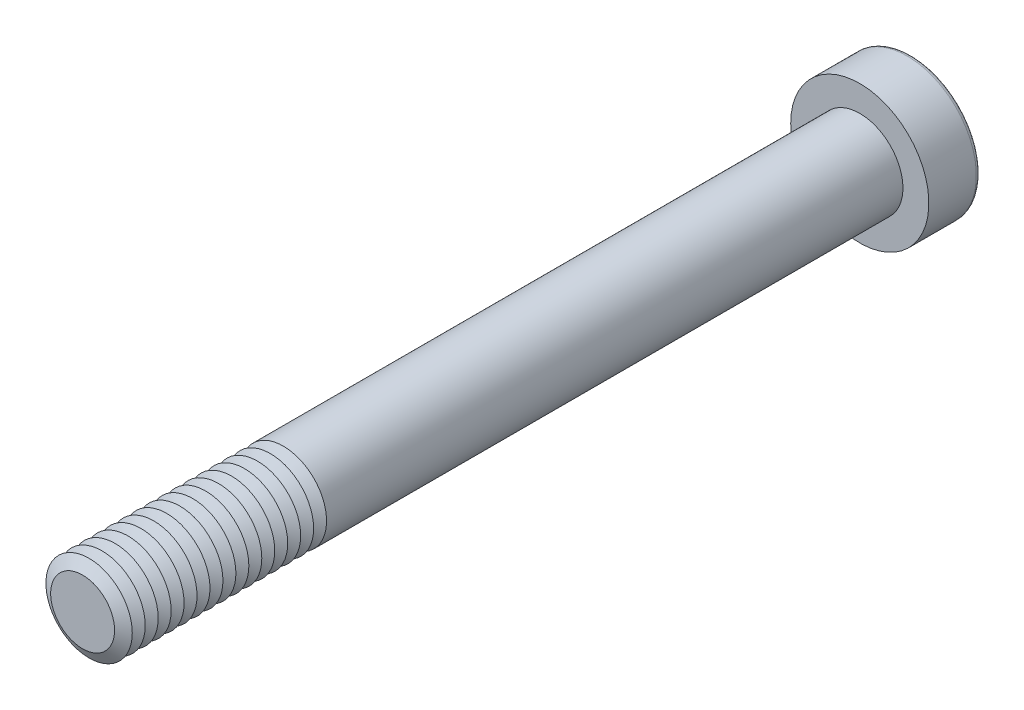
ISO-10303-21;
HEADER;
FILE_DESCRIPTION(('STEP AP214'),'2;1');
FILE_NAME('part.step','',(''),(''),'','','');
FILE_SCHEMA(('AUTOMOTIVE_DESIGN { 1 0 10303 214 1 1 1 1 }'));
ENDSEC;
DATA;
#1=APPLICATION_CONTEXT('core data for automotive mechanical design processes');
#2=APPLICATION_PROTOCOL_DEFINITION('international standard','automotive_design',2000,#1);
#3=PRODUCT_CONTEXT('',#1,'mechanical');
#4=PRODUCT('Part','Part','',(#3));
#5=PRODUCT_RELATED_PRODUCT_CATEGORY('part','',(#4));
#6=PRODUCT_DEFINITION_FORMATION('','',#4);
#7=PRODUCT_DEFINITION_CONTEXT('part definition',#1,'design');
#8=PRODUCT_DEFINITION('design','',#6,#7);
#9=PRODUCT_DEFINITION_SHAPE('','',#8);
#10=(LENGTH_UNIT() NAMED_UNIT(*) SI_UNIT(.MILLI.,.METRE.));
#11=(NAMED_UNIT(*) PLANE_ANGLE_UNIT() SI_UNIT($,.RADIAN.));
#12=(NAMED_UNIT(*) SI_UNIT($,.STERADIAN.) SOLID_ANGLE_UNIT());
#13=UNCERTAINTY_MEASURE_WITH_UNIT(LENGTH_MEASURE(1.E-05),#10,'distance_accuracy_value','');
#14=(GEOMETRIC_REPRESENTATION_CONTEXT(3) GLOBAL_UNCERTAINTY_ASSIGNED_CONTEXT((#13)) GLOBAL_UNIT_ASSIGNED_CONTEXT((#10,
#11,#12)) REPRESENTATION_CONTEXT('',''));
#15=CARTESIAN_POINT('',(0.,0.,0.));
#16=DIRECTION('',(0.,0.,1.));
#17=DIRECTION('',(1.,0.,0.));
#18=AXIS2_PLACEMENT_3D('',#15,#16,#17);
#19=CARTESIAN_POINT('',(0.,0.,84.75));
#20=DIRECTION('',(0.,0.,1.));
#21=DIRECTION('',(1.,0.,0.));
#22=AXIS2_PLACEMENT_3D('',#19,#20,#21);
#23=CONICAL_SURFACE('',#22,5.,1.0471975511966);
#24=CARTESIAN_POINT('',(0.,0.,84.));
#25=DIRECTION('',(0.,0.,1.));
#26=DIRECTION('',(1.,0.,0.));
#27=AXIS2_PLACEMENT_3D('',#24,#25,#26);
#28=CIRCLE('',#27,3.70096189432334);
#29=CARTESIAN_POINT('',(3.70096189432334,0.,84.));
#30=VERTEX_POINT('',#29);
#31=EDGE_CURVE('E313',#30,#30,#28,.T.);
#32=ORIENTED_EDGE('',*,*,#31,.T.);
#33=EDGE_LOOP('',(#32));
#34=FACE_BOUND('',#33,.T.);
#35=CARTESIAN_POINT('',(0.,0.,84.75));
#36=DIRECTION('',(0.,0.,1.));
#37=DIRECTION('',(1.,0.,0.));
#38=AXIS2_PLACEMENT_3D('',#35,#36,#37);
#39=CIRCLE('',#38,5.);
#40=CARTESIAN_POINT('',(5.,0.,84.75));
#41=VERTEX_POINT('',#40);
#42=EDGE_CURVE('E316',#41,#41,#39,.T.);
#43=ORIENTED_EDGE('',*,*,#42,.F.);
#44=EDGE_LOOP('',(#43));
#45=FACE_BOUND('',#44,.T.);
#46=ADVANCED_FACE('F39',(#34,#45),#23,.T.);
#47=CARTESIAN_POINT('',(0.,0.,84.));
#48=DIRECTION('',(0.,0.,-1.));
#49=DIRECTION('',(-1.,0.,0.));
#50=AXIS2_PLACEMENT_3D('',#47,#48,#49);
#51=CONICAL_SURFACE('',#50,3.70096189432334,1.0471975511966);
#52=CARTESIAN_POINT('',(0.,0.,83.25));
#53=DIRECTION('',(0.,0.,1.));
#54=DIRECTION('',(1.,0.,0.));
#55=AXIS2_PLACEMENT_3D('',#52,#53,#54);
#56=CIRCLE('',#55,5.);
#57=CARTESIAN_POINT('',(5.,0.,83.25));
#58=VERTEX_POINT('',#57);
#59=EDGE_CURVE('E323',#58,#58,#56,.T.);
#60=ORIENTED_EDGE('',*,*,#59,.T.);
#61=EDGE_LOOP('',(#60));
#62=FACE_BOUND('',#61,.T.);
#63=ORIENTED_EDGE('',*,*,#31,.F.);
#64=EDGE_LOOP('',(#63));
#65=FACE_BOUND('',#64,.T.);
#66=ADVANCED_FACE('F245',(#62,#65),#51,.T.);
#67=CARTESIAN_POINT('',(0.,0.,90.));
#68=DIRECTION('',(0.,0.,1.));
#69=DIRECTION('',(1.,0.,0.));
#70=AXIS2_PLACEMENT_3D('',#67,#68,#69);
#71=PLANE('',#70);
#72=CARTESIAN_POINT('',(0.,0.,90.));
#73=DIRECTION('',(0.,0.,1.));
#74=DIRECTION('',(1.,0.,0.));
#75=AXIS2_PLACEMENT_3D('',#72,#73,#74);
#76=CIRCLE('',#75,3.70096189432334);
#77=CARTESIAN_POINT('',(3.70096189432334,0.,90.));
#78=VERTEX_POINT('',#77);
#79=EDGE_CURVE('E174',#78,#78,#76,.T.);
#80=ORIENTED_EDGE('',*,*,#79,.T.);
#81=EDGE_LOOP('',(#80));
#82=FACE_BOUND('',#81,.T.);
#83=ADVANCED_FACE('F251',(#82),#71,.T.);
#84=CARTESIAN_POINT('',(0.,0.,90.));
#85=DIRECTION('',(0.,0.,-1.));
#86=DIRECTION('',(-1.,0.,0.));
#87=AXIS2_PLACEMENT_3D('',#84,#85,#86);
#88=CONICAL_SURFACE('',#87,3.70096189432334,1.0471975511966);
#89=CARTESIAN_POINT('',(0.,0.,89.25));
#90=DIRECTION('',(0.,0.,1.));
#91=DIRECTION('',(1.,0.,0.));
#92=AXIS2_PLACEMENT_3D('',#89,#90,#91);
#93=CIRCLE('',#92,5.);
#94=CARTESIAN_POINT('',(5.,0.,89.25));
#95=VERTEX_POINT('',#94);
#96=EDGE_CURVE('E291',#95,#95,#93,.T.);
#97=ORIENTED_EDGE('',*,*,#96,.T.);
#98=EDGE_LOOP('',(#97));
#99=FACE_BOUND('',#98,.T.);
#100=ORIENTED_EDGE('',*,*,#79,.F.);
#101=EDGE_LOOP('',(#100));
#102=FACE_BOUND('',#101,.T.);
#103=ADVANCED_FACE('F199',(#99,#102),#88,.T.);
#104=CARTESIAN_POINT('',(0.,0.,89.25));
#105=DIRECTION('',(0.,0.,1.));
#106=DIRECTION('',(1.,0.,0.));
#107=AXIS2_PLACEMENT_3D('',#104,#105,#106);
#108=CONICAL_SURFACE('',#107,5.,1.0471975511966);
#109=CARTESIAN_POINT('',(0.,0.,88.5));
#110=DIRECTION('',(0.,0.,1.));
#111=DIRECTION('',(1.,0.,0.));
#112=AXIS2_PLACEMENT_3D('',#109,#110,#111);
#113=CIRCLE('',#112,3.70096189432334);
#114=CARTESIAN_POINT('',(3.70096189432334,0.,88.5));
#115=VERTEX_POINT('',#114);
#116=EDGE_CURVE('E288',#115,#115,#113,.T.);
#117=ORIENTED_EDGE('',*,*,#116,.T.);
#118=EDGE_LOOP('',(#117));
#119=FACE_BOUND('',#118,.T.);
#120=ORIENTED_EDGE('',*,*,#96,.F.);
#121=EDGE_LOOP('',(#120));
#122=FACE_BOUND('',#121,.T.);
#123=ADVANCED_FACE('F277',(#119,#122),#108,.T.);
#124=CARTESIAN_POINT('',(0.,0.,88.5));
#125=DIRECTION('',(0.,0.,-1.));
#126=DIRECTION('',(-1.,0.,0.));
#127=AXIS2_PLACEMENT_3D('',#124,#125,#126);
#128=CONICAL_SURFACE('',#127,3.70096189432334,1.0471975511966);
#129=CARTESIAN_POINT('',(0.,0.,87.75));
#130=DIRECTION('',(0.,0.,1.));
#131=DIRECTION('',(1.,0.,0.));
#132=AXIS2_PLACEMENT_3D('',#129,#130,#131);
#133=CIRCLE('',#132,5.);
#134=CARTESIAN_POINT('',(5.,0.,87.75));
#135=VERTEX_POINT('',#134);
#136=EDGE_CURVE('E299',#135,#135,#133,.T.);
#137=ORIENTED_EDGE('',*,*,#136,.T.);
#138=EDGE_LOOP('',(#137));
#139=FACE_BOUND('',#138,.T.);
#140=ORIENTED_EDGE('',*,*,#116,.F.);
#141=EDGE_LOOP('',(#140));
#142=FACE_BOUND('',#141,.T.);
#143=ADVANCED_FACE('F274',(#139,#142),#128,.T.);
#144=CARTESIAN_POINT('',(0.,0.,87.75));
#145=DIRECTION('',(0.,0.,1.));
#146=DIRECTION('',(1.,0.,0.));
#147=AXIS2_PLACEMENT_3D('',#144,#145,#146);
#148=CONICAL_SURFACE('',#147,5.,1.0471975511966);
#149=CARTESIAN_POINT('',(0.,0.,87.));
#150=DIRECTION('',(0.,0.,1.));
#151=DIRECTION('',(1.,0.,0.));
#152=AXIS2_PLACEMENT_3D('',#149,#150,#151);
#153=CIRCLE('',#152,3.70096189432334);
#154=CARTESIAN_POINT('',(3.70096189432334,0.,87.));
#155=VERTEX_POINT('',#154);
#156=EDGE_CURVE('E293',#155,#155,#153,.T.);
#157=ORIENTED_EDGE('',*,*,#156,.T.);
#158=EDGE_LOOP('',(#157));
#159=FACE_BOUND('',#158,.T.);
#160=ORIENTED_EDGE('',*,*,#136,.F.);
#161=EDGE_LOOP('',(#160));
#162=FACE_BOUND('',#161,.T.);
#163=ADVANCED_FACE('F270',(#159,#162),#148,.T.);
#164=CARTESIAN_POINT('',(0.,0.,87.));
#165=DIRECTION('',(0.,0.,-1.));
#166=DIRECTION('',(-1.,0.,0.));
#167=AXIS2_PLACEMENT_3D('',#164,#165,#166);
#168=CONICAL_SURFACE('',#167,3.70096189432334,1.0471975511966);
#169=CARTESIAN_POINT('',(0.,0.,86.25));
#170=DIRECTION('',(0.,0.,1.));
#171=DIRECTION('',(1.,0.,0.));
#172=AXIS2_PLACEMENT_3D('',#169,#170,#171);
#173=CIRCLE('',#172,5.);
#174=CARTESIAN_POINT('',(5.,0.,86.25));
#175=VERTEX_POINT('',#174);
#176=EDGE_CURVE('E309',#175,#175,#173,.T.);
#177=ORIENTED_EDGE('',*,*,#176,.T.);
#178=EDGE_LOOP('',(#177));
#179=FACE_BOUND('',#178,.T.);
#180=ORIENTED_EDGE('',*,*,#156,.F.);
#181=EDGE_LOOP('',(#180));
#182=FACE_BOUND('',#181,.T.);
#183=ADVANCED_FACE('F266',(#179,#182),#168,.T.);
#184=CARTESIAN_POINT('',(0.,0.,86.25));
#185=DIRECTION('',(0.,0.,1.));
#186=DIRECTION('',(1.,0.,0.));
#187=AXIS2_PLACEMENT_3D('',#184,#185,#186);
#188=CONICAL_SURFACE('',#187,5.,1.0471975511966);
#189=CARTESIAN_POINT('',(0.,0.,85.5));
#190=DIRECTION('',(0.,0.,1.));
#191=DIRECTION('',(1.,0.,0.));
#192=AXIS2_PLACEMENT_3D('',#189,#190,#191);
#193=CIRCLE('',#192,3.70096189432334);
#194=CARTESIAN_POINT('',(3.70096189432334,0.,85.5));
#195=VERTEX_POINT('',#194);
#196=EDGE_CURVE('E305',#195,#195,#193,.T.);
#197=ORIENTED_EDGE('',*,*,#196,.T.);
#198=EDGE_LOOP('',(#197));
#199=FACE_BOUND('',#198,.T.);
#200=ORIENTED_EDGE('',*,*,#176,.F.);
#201=EDGE_LOOP('',(#200));
#202=FACE_BOUND('',#201,.T.);
#203=ADVANCED_FACE('F262',(#199,#202),#188,.T.);
#204=CARTESIAN_POINT('',(0.,0.,85.5));
#205=DIRECTION('',(0.,0.,-1.));
#206=DIRECTION('',(-1.,0.,0.));
#207=AXIS2_PLACEMENT_3D('',#204,#205,#206);
#208=CONICAL_SURFACE('',#207,3.70096189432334,1.0471975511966);
#209=ORIENTED_EDGE('',*,*,#42,.T.);
#210=EDGE_LOOP('',(#209));
#211=FACE_BOUND('',#210,.T.);
#212=ORIENTED_EDGE('',*,*,#196,.F.);
#213=EDGE_LOOP('',(#212));
#214=FACE_BOUND('',#213,.T.);
#215=ADVANCED_FACE('F258',(#211,#214),#208,.T.);
#216=CARTESIAN_POINT('',(0.,0.,83.25));
#217=DIRECTION('',(0.,0.,1.));
#218=DIRECTION('',(1.,0.,0.));
#219=AXIS2_PLACEMENT_3D('',#216,#217,#218);
#220=CONICAL_SURFACE('',#219,5.,1.0471975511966);
#221=CARTESIAN_POINT('',(0.,0.,82.5));
#222=DIRECTION('',(0.,0.,1.));
#223=DIRECTION('',(1.,0.,0.));
#224=AXIS2_PLACEMENT_3D('',#221,#222,#223);
#225=CIRCLE('',#224,3.70096189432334);
#226=CARTESIAN_POINT('',(3.70096189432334,0.,82.5));
#227=VERTEX_POINT('',#226);
#228=EDGE_CURVE('E320',#227,#227,#225,.T.);
#229=ORIENTED_EDGE('',*,*,#228,.T.);
#230=EDGE_LOOP('',(#229));
#231=FACE_BOUND('',#230,.T.);
#232=ORIENTED_EDGE('',*,*,#59,.F.);
#233=EDGE_LOOP('',(#232));
#234=FACE_BOUND('',#233,.T.);
#235=ADVANCED_FACE('F261',(#231,#234),#220,.T.);
#236=CARTESIAN_POINT('',(0.,0.,82.5));
#237=DIRECTION('',(0.,0.,-1.));
#238=DIRECTION('',(-1.,0.,0.));
#239=AXIS2_PLACEMENT_3D('',#236,#237,#238);
#240=CONICAL_SURFACE('',#239,3.70096189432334,1.0471975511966);
#241=CARTESIAN_POINT('',(0.,0.,81.75));
#242=DIRECTION('',(0.,0.,1.));
#243=DIRECTION('',(1.,0.,0.));
#244=AXIS2_PLACEMENT_3D('',#241,#242,#243);
#245=CIRCLE('',#244,5.);
#246=CARTESIAN_POINT('',(5.,0.,81.75));
#247=VERTEX_POINT('',#246);
#248=EDGE_CURVE('E331',#247,#247,#245,.T.);
#249=ORIENTED_EDGE('',*,*,#248,.T.);
#250=EDGE_LOOP('',(#249));
#251=FACE_BOUND('',#250,.T.);
#252=ORIENTED_EDGE('',*,*,#228,.F.);
#253=EDGE_LOOP('',(#252));
#254=FACE_BOUND('',#253,.T.);
#255=ADVANCED_FACE('F495',(#251,#254),#240,.T.);
#256=CARTESIAN_POINT('',(0.,0.,81.75));
#257=DIRECTION('',(0.,0.,1.));
#258=DIRECTION('',(1.,0.,0.));
#259=AXIS2_PLACEMENT_3D('',#256,#257,#258);
#260=CONICAL_SURFACE('',#259,5.,1.0471975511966);
#261=CARTESIAN_POINT('',(0.,0.,81.));
#262=DIRECTION('',(0.,0.,1.));
#263=DIRECTION('',(1.,0.,0.));
#264=AXIS2_PLACEMENT_3D('',#261,#262,#263);
#265=CIRCLE('',#264,3.70096189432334);
#266=CARTESIAN_POINT('',(3.70096189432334,0.,81.));
#267=VERTEX_POINT('',#266);
#268=EDGE_CURVE('E327',#267,#267,#265,.T.);
#269=ORIENTED_EDGE('',*,*,#268,.T.);
#270=EDGE_LOOP('',(#269));
#271=FACE_BOUND('',#270,.T.);
#272=ORIENTED_EDGE('',*,*,#248,.F.);
#273=EDGE_LOOP('',(#272));
#274=FACE_BOUND('',#273,.T.);
#275=ADVANCED_FACE('F491',(#271,#274),#260,.T.);
#276=CARTESIAN_POINT('',(0.,0.,81.));
#277=DIRECTION('',(0.,0.,-1.));
#278=DIRECTION('',(-1.,0.,0.));
#279=AXIS2_PLACEMENT_3D('',#276,#277,#278);
#280=CONICAL_SURFACE('',#279,3.70096189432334,1.0471975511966);
#281=CARTESIAN_POINT('',(0.,0.,80.25));
#282=DIRECTION('',(0.,0.,1.));
#283=DIRECTION('',(1.,0.,0.));
#284=AXIS2_PLACEMENT_3D('',#281,#282,#283);
#285=CIRCLE('',#284,5.);
#286=CARTESIAN_POINT('',(5.,0.,80.25));
#287=VERTEX_POINT('',#286);
#288=EDGE_CURVE('E339',#287,#287,#285,.T.);
#289=ORIENTED_EDGE('',*,*,#288,.T.);
#290=EDGE_LOOP('',(#289));
#291=FACE_BOUND('',#290,.T.);
#292=ORIENTED_EDGE('',*,*,#268,.F.);
#293=EDGE_LOOP('',(#292));
#294=FACE_BOUND('',#293,.T.);
#295=ADVANCED_FACE('F487',(#291,#294),#280,.T.);
#296=CARTESIAN_POINT('',(0.,0.,80.25));
#297=DIRECTION('',(0.,0.,1.));
#298=DIRECTION('',(1.,0.,0.));
#299=AXIS2_PLACEMENT_3D('',#296,#297,#298);
#300=CONICAL_SURFACE('',#299,5.,1.0471975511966);
#301=CARTESIAN_POINT('',(0.,0.,79.5));
#302=DIRECTION('',(0.,0.,1.));
#303=DIRECTION('',(1.,0.,0.));
#304=AXIS2_PLACEMENT_3D('',#301,#302,#303);
#305=CIRCLE('',#304,3.70096189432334);
#306=CARTESIAN_POINT('',(3.70096189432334,0.,79.5));
#307=VERTEX_POINT('',#306);
#308=EDGE_CURVE('E335',#307,#307,#305,.T.);
#309=ORIENTED_EDGE('',*,*,#308,.T.);
#310=EDGE_LOOP('',(#309));
#311=FACE_BOUND('',#310,.T.);
#312=ORIENTED_EDGE('',*,*,#288,.F.);
#313=EDGE_LOOP('',(#312));
#314=FACE_BOUND('',#313,.T.);
#315=ADVANCED_FACE('F483',(#311,#314),#300,.T.);
#316=CARTESIAN_POINT('',(0.,0.,79.5));
#317=DIRECTION('',(0.,0.,-1.));
#318=DIRECTION('',(-1.,0.,0.));
#319=AXIS2_PLACEMENT_3D('',#316,#317,#318);
#320=CONICAL_SURFACE('',#319,3.70096189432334,1.0471975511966);
#321=CARTESIAN_POINT('',(0.,0.,78.75));
#322=DIRECTION('',(0.,0.,1.));
#323=DIRECTION('',(1.,0.,0.));
#324=AXIS2_PLACEMENT_3D('',#321,#322,#323);
#325=CIRCLE('',#324,5.);
#326=CARTESIAN_POINT('',(5.,0.,78.75));
#327=VERTEX_POINT('',#326);
#328=EDGE_CURVE('E347',#327,#327,#325,.T.);
#329=ORIENTED_EDGE('',*,*,#328,.T.);
#330=EDGE_LOOP('',(#329));
#331=FACE_BOUND('',#330,.T.);
#332=ORIENTED_EDGE('',*,*,#308,.F.);
#333=EDGE_LOOP('',(#332));
#334=FACE_BOUND('',#333,.T.);
#335=ADVANCED_FACE('F479',(#331,#334),#320,.T.);
#336=CARTESIAN_POINT('',(0.,0.,78.75));
#337=DIRECTION('',(0.,0.,1.));
#338=DIRECTION('',(1.,0.,0.));
#339=AXIS2_PLACEMENT_3D('',#336,#337,#338);
#340=CONICAL_SURFACE('',#339,5.,1.0471975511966);
#341=CARTESIAN_POINT('',(0.,0.,78.));
#342=DIRECTION('',(0.,0.,1.));
#343=DIRECTION('',(1.,0.,0.));
#344=AXIS2_PLACEMENT_3D('',#341,#342,#343);
#345=CIRCLE('',#344,3.70096189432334);
#346=CARTESIAN_POINT('',(3.70096189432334,0.,78.));
#347=VERTEX_POINT('',#346);
#348=EDGE_CURVE('E343',#347,#347,#345,.T.);
#349=ORIENTED_EDGE('',*,*,#348,.T.);
#350=EDGE_LOOP('',(#349));
#351=FACE_BOUND('',#350,.T.);
#352=ORIENTED_EDGE('',*,*,#328,.F.);
#353=EDGE_LOOP('',(#352));
#354=FACE_BOUND('',#353,.T.);
#355=ADVANCED_FACE('F475',(#351,#354),#340,.T.);
#356=CARTESIAN_POINT('',(0.,0.,78.));
#357=DIRECTION('',(0.,0.,-1.));
#358=DIRECTION('',(-1.,0.,0.));
#359=AXIS2_PLACEMENT_3D('',#356,#357,#358);
#360=CONICAL_SURFACE('',#359,3.70096189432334,1.0471975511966);
#361=CARTESIAN_POINT('',(0.,0.,77.25));
#362=DIRECTION('',(0.,0.,1.));
#363=DIRECTION('',(1.,0.,0.));
#364=AXIS2_PLACEMENT_3D('',#361,#362,#363);
#365=CIRCLE('',#364,5.);
#366=CARTESIAN_POINT('',(5.,0.,77.25));
#367=VERTEX_POINT('',#366);
#368=EDGE_CURVE('E355',#367,#367,#365,.T.);
#369=ORIENTED_EDGE('',*,*,#368,.T.);
#370=EDGE_LOOP('',(#369));
#371=FACE_BOUND('',#370,.T.);
#372=ORIENTED_EDGE('',*,*,#348,.F.);
#373=EDGE_LOOP('',(#372));
#374=FACE_BOUND('',#373,.T.);
#375=ADVANCED_FACE('F471',(#371,#374),#360,.T.);
#376=CARTESIAN_POINT('',(0.,0.,77.25));
#377=DIRECTION('',(0.,0.,1.));
#378=DIRECTION('',(1.,0.,0.));
#379=AXIS2_PLACEMENT_3D('',#376,#377,#378);
#380=CONICAL_SURFACE('',#379,5.,1.0471975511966);
#381=CARTESIAN_POINT('',(0.,0.,76.5));
#382=DIRECTION('',(0.,0.,1.));
#383=DIRECTION('',(1.,0.,0.));
#384=AXIS2_PLACEMENT_3D('',#381,#382,#383);
#385=CIRCLE('',#384,3.70096189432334);
#386=CARTESIAN_POINT('',(3.70096189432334,0.,76.5));
#387=VERTEX_POINT('',#386);
#388=EDGE_CURVE('E351',#387,#387,#385,.T.);
#389=ORIENTED_EDGE('',*,*,#388,.T.);
#390=EDGE_LOOP('',(#389));
#391=FACE_BOUND('',#390,.T.);
#392=ORIENTED_EDGE('',*,*,#368,.F.);
#393=EDGE_LOOP('',(#392));
#394=FACE_BOUND('',#393,.T.);
#395=ADVANCED_FACE('F467',(#391,#394),#380,.T.);
#396=CARTESIAN_POINT('',(0.,0.,76.5));
#397=DIRECTION('',(0.,0.,-1.));
#398=DIRECTION('',(-1.,0.,0.));
#399=AXIS2_PLACEMENT_3D('',#396,#397,#398);
#400=CONICAL_SURFACE('',#399,3.70096189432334,1.0471975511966);
#401=CARTESIAN_POINT('',(0.,0.,75.75));
#402=DIRECTION('',(0.,0.,1.));
#403=DIRECTION('',(1.,0.,0.));
#404=AXIS2_PLACEMENT_3D('',#401,#402,#403);
#405=CIRCLE('',#404,5.);
#406=CARTESIAN_POINT('',(5.,0.,75.75));
#407=VERTEX_POINT('',#406);
#408=EDGE_CURVE('E363',#407,#407,#405,.T.);
#409=ORIENTED_EDGE('',*,*,#408,.T.);
#410=EDGE_LOOP('',(#409));
#411=FACE_BOUND('',#410,.T.);
#412=ORIENTED_EDGE('',*,*,#388,.F.);
#413=EDGE_LOOP('',(#412));
#414=FACE_BOUND('',#413,.T.);
#415=ADVANCED_FACE('F463',(#411,#414),#400,.T.);
#416=CARTESIAN_POINT('',(0.,0.,75.75));
#417=DIRECTION('',(0.,0.,1.));
#418=DIRECTION('',(1.,0.,0.));
#419=AXIS2_PLACEMENT_3D('',#416,#417,#418);
#420=CONICAL_SURFACE('',#419,5.,1.0471975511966);
#421=CARTESIAN_POINT('',(0.,0.,75.));
#422=DIRECTION('',(0.,0.,1.));
#423=DIRECTION('',(1.,0.,0.));
#424=AXIS2_PLACEMENT_3D('',#421,#422,#423);
#425=CIRCLE('',#424,3.70096189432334);
#426=CARTESIAN_POINT('',(3.70096189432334,0.,75.));
#427=VERTEX_POINT('',#426);
#428=EDGE_CURVE('E359',#427,#427,#425,.T.);
#429=ORIENTED_EDGE('',*,*,#428,.T.);
#430=EDGE_LOOP('',(#429));
#431=FACE_BOUND('',#430,.T.);
#432=ORIENTED_EDGE('',*,*,#408,.F.);
#433=EDGE_LOOP('',(#432));
#434=FACE_BOUND('',#433,.T.);
#435=ADVANCED_FACE('F459',(#431,#434),#420,.T.);
#436=CARTESIAN_POINT('',(0.,0.,75.));
#437=DIRECTION('',(0.,0.,-1.));
#438=DIRECTION('',(-1.,0.,0.));
#439=AXIS2_PLACEMENT_3D('',#436,#437,#438);
#440=CONICAL_SURFACE('',#439,3.70096189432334,1.0471975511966);
#441=CARTESIAN_POINT('',(0.,0.,74.25));
#442=DIRECTION('',(0.,0.,1.));
#443=DIRECTION('',(1.,0.,0.));
#444=AXIS2_PLACEMENT_3D('',#441,#442,#443);
#445=CIRCLE('',#444,5.);
#446=CARTESIAN_POINT('',(5.,0.,74.25));
#447=VERTEX_POINT('',#446);
#448=EDGE_CURVE('E371',#447,#447,#445,.T.);
#449=ORIENTED_EDGE('',*,*,#448,.T.);
#450=EDGE_LOOP('',(#449));
#451=FACE_BOUND('',#450,.T.);
#452=ORIENTED_EDGE('',*,*,#428,.F.);
#453=EDGE_LOOP('',(#452));
#454=FACE_BOUND('',#453,.T.);
#455=ADVANCED_FACE('F455',(#451,#454),#440,.T.);
#456=CARTESIAN_POINT('',(0.,0.,74.25));
#457=DIRECTION('',(0.,0.,1.));
#458=DIRECTION('',(1.,0.,0.));
#459=AXIS2_PLACEMENT_3D('',#456,#457,#458);
#460=CONICAL_SURFACE('',#459,5.,1.0471975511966);
#461=CARTESIAN_POINT('',(0.,0.,73.5));
#462=DIRECTION('',(0.,0.,1.));
#463=DIRECTION('',(1.,0.,0.));
#464=AXIS2_PLACEMENT_3D('',#461,#462,#463);
#465=CIRCLE('',#464,3.70096189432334);
#466=CARTESIAN_POINT('',(3.70096189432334,0.,73.5));
#467=VERTEX_POINT('',#466);
#468=EDGE_CURVE('E367',#467,#467,#465,.T.);
#469=ORIENTED_EDGE('',*,*,#468,.T.);
#470=EDGE_LOOP('',(#469));
#471=FACE_BOUND('',#470,.T.);
#472=ORIENTED_EDGE('',*,*,#448,.F.);
#473=EDGE_LOOP('',(#472));
#474=FACE_BOUND('',#473,.T.);
#475=ADVANCED_FACE('F451',(#471,#474),#460,.T.);
#476=CARTESIAN_POINT('',(0.,0.,73.5));
#477=DIRECTION('',(0.,0.,-1.));
#478=DIRECTION('',(-1.,0.,0.));
#479=AXIS2_PLACEMENT_3D('',#476,#477,#478);
#480=CONICAL_SURFACE('',#479,3.70096189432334,1.0471975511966);
#481=CARTESIAN_POINT('',(0.,0.,72.75));
#482=DIRECTION('',(0.,0.,1.));
#483=DIRECTION('',(1.,0.,0.));
#484=AXIS2_PLACEMENT_3D('',#481,#482,#483);
#485=CIRCLE('',#484,5.);
#486=CARTESIAN_POINT('',(5.,0.,72.75));
#487=VERTEX_POINT('',#486);
#488=EDGE_CURVE('E379',#487,#487,#485,.T.);
#489=ORIENTED_EDGE('',*,*,#488,.T.);
#490=EDGE_LOOP('',(#489));
#491=FACE_BOUND('',#490,.T.);
#492=ORIENTED_EDGE('',*,*,#468,.F.);
#493=EDGE_LOOP('',(#492));
#494=FACE_BOUND('',#493,.T.);
#495=ADVANCED_FACE('F447',(#491,#494),#480,.T.);
#496=CARTESIAN_POINT('',(0.,0.,72.75));
#497=DIRECTION('',(0.,0.,1.));
#498=DIRECTION('',(1.,0.,0.));
#499=AXIS2_PLACEMENT_3D('',#496,#497,#498);
#500=CONICAL_SURFACE('',#499,5.,1.0471975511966);
#501=CARTESIAN_POINT('',(0.,0.,72.));
#502=DIRECTION('',(0.,0.,1.));
#503=DIRECTION('',(1.,0.,0.));
#504=AXIS2_PLACEMENT_3D('',#501,#502,#503);
#505=CIRCLE('',#504,3.70096189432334);
#506=CARTESIAN_POINT('',(3.70096189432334,0.,72.));
#507=VERTEX_POINT('',#506);
#508=EDGE_CURVE('E375',#507,#507,#505,.T.);
#509=ORIENTED_EDGE('',*,*,#508,.T.);
#510=EDGE_LOOP('',(#509));
#511=FACE_BOUND('',#510,.T.);
#512=ORIENTED_EDGE('',*,*,#488,.F.);
#513=EDGE_LOOP('',(#512));
#514=FACE_BOUND('',#513,.T.);
#515=ADVANCED_FACE('F443',(#511,#514),#500,.T.);
#516=CARTESIAN_POINT('',(0.,0.,72.));
#517=DIRECTION('',(0.,0.,-1.));
#518=DIRECTION('',(-1.,0.,0.));
#519=AXIS2_PLACEMENT_3D('',#516,#517,#518);
#520=CONICAL_SURFACE('',#519,3.70096189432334,1.0471975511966);
#521=CARTESIAN_POINT('',(0.,0.,71.25));
#522=DIRECTION('',(0.,0.,1.));
#523=DIRECTION('',(1.,0.,0.));
#524=AXIS2_PLACEMENT_3D('',#521,#522,#523);
#525=CIRCLE('',#524,5.);
#526=CARTESIAN_POINT('',(5.,0.,71.25));
#527=VERTEX_POINT('',#526);
#528=EDGE_CURVE('E387',#527,#527,#525,.T.);
#529=ORIENTED_EDGE('',*,*,#528,.T.);
#530=EDGE_LOOP('',(#529));
#531=FACE_BOUND('',#530,.T.);
#532=ORIENTED_EDGE('',*,*,#508,.F.);
#533=EDGE_LOOP('',(#532));
#534=FACE_BOUND('',#533,.T.);
#535=ADVANCED_FACE('F439',(#531,#534),#520,.T.);
#536=CARTESIAN_POINT('',(0.,0.,71.25));
#537=DIRECTION('',(0.,0.,1.));
#538=DIRECTION('',(1.,0.,0.));
#539=AXIS2_PLACEMENT_3D('',#536,#537,#538);
#540=CONICAL_SURFACE('',#539,5.,1.0471975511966);
#541=CARTESIAN_POINT('',(0.,0.,70.5));
#542=DIRECTION('',(0.,0.,1.));
#543=DIRECTION('',(1.,0.,0.));
#544=AXIS2_PLACEMENT_3D('',#541,#542,#543);
#545=CIRCLE('',#544,3.70096189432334);
#546=CARTESIAN_POINT('',(3.70096189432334,0.,70.5));
#547=VERTEX_POINT('',#546);
#548=EDGE_CURVE('E383',#547,#547,#545,.T.);
#549=ORIENTED_EDGE('',*,*,#548,.T.);
#550=EDGE_LOOP('',(#549));
#551=FACE_BOUND('',#550,.T.);
#552=ORIENTED_EDGE('',*,*,#528,.F.);
#553=EDGE_LOOP('',(#552));
#554=FACE_BOUND('',#553,.T.);
#555=ADVANCED_FACE('F435',(#551,#554),#540,.T.);
#556=CARTESIAN_POINT('',(0.,0.,70.5));
#557=DIRECTION('',(0.,0.,-1.));
#558=DIRECTION('',(-1.,0.,0.));
#559=AXIS2_PLACEMENT_3D('',#556,#557,#558);
#560=CONICAL_SURFACE('',#559,3.70096189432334,1.0471975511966);
#561=CARTESIAN_POINT('',(0.,0.,69.75));
#562=DIRECTION('',(0.,0.,1.));
#563=DIRECTION('',(1.,0.,0.));
#564=AXIS2_PLACEMENT_3D('',#561,#562,#563);
#565=CIRCLE('',#564,5.);
#566=CARTESIAN_POINT('',(5.,0.,69.75));
#567=VERTEX_POINT('',#566);
#568=EDGE_CURVE('E395',#567,#567,#565,.T.);
#569=ORIENTED_EDGE('',*,*,#568,.T.);
#570=EDGE_LOOP('',(#569));
#571=FACE_BOUND('',#570,.T.);
#572=ORIENTED_EDGE('',*,*,#548,.F.);
#573=EDGE_LOOP('',(#572));
#574=FACE_BOUND('',#573,.T.);
#575=ADVANCED_FACE('F431',(#571,#574),#560,.T.);
#576=CARTESIAN_POINT('',(0.,0.,69.75));
#577=DIRECTION('',(0.,0.,1.));
#578=DIRECTION('',(1.,0.,0.));
#579=AXIS2_PLACEMENT_3D('',#576,#577,#578);
#580=CONICAL_SURFACE('',#579,5.,1.0471975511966);
#581=CARTESIAN_POINT('',(0.,0.,69.));
#582=DIRECTION('',(0.,0.,1.));
#583=DIRECTION('',(1.,0.,0.));
#584=AXIS2_PLACEMENT_3D('',#581,#582,#583);
#585=CIRCLE('',#584,3.70096189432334);
#586=CARTESIAN_POINT('',(3.70096189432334,0.,69.));
#587=VERTEX_POINT('',#586);
#588=EDGE_CURVE('E391',#587,#587,#585,.T.);
#589=ORIENTED_EDGE('',*,*,#588,.T.);
#590=EDGE_LOOP('',(#589));
#591=FACE_BOUND('',#590,.T.);
#592=ORIENTED_EDGE('',*,*,#568,.F.);
#593=EDGE_LOOP('',(#592));
#594=FACE_BOUND('',#593,.T.);
#595=ADVANCED_FACE('F426',(#591,#594),#580,.T.);
#596=CARTESIAN_POINT('',(0.,0.,69.));
#597=DIRECTION('',(0.,0.,-1.));
#598=DIRECTION('',(-1.,0.,0.));
#599=AXIS2_PLACEMENT_3D('',#596,#597,#598);
#600=CONICAL_SURFACE('',#599,3.70096189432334,1.0471975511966);
#601=CARTESIAN_POINT('',(0.,0.,68.25));
#602=DIRECTION('',(0.,0.,1.));
#603=DIRECTION('',(1.,0.,0.));
#604=AXIS2_PLACEMENT_3D('',#601,#602,#603);
#605=CIRCLE('',#604,5.);
#606=CARTESIAN_POINT('',(5.,0.,68.25));
#607=VERTEX_POINT('',#606);
#608=EDGE_CURVE('E407',#607,#607,#605,.T.);
#609=ORIENTED_EDGE('',*,*,#608,.T.);
#610=EDGE_LOOP('',(#609));
#611=FACE_BOUND('',#610,.T.);
#612=ORIENTED_EDGE('',*,*,#588,.F.);
#613=EDGE_LOOP('',(#612));
#614=FACE_BOUND('',#613,.T.);
#615=ADVANCED_FACE('F412',(#611,#614),#600,.T.);
#616=CARTESIAN_POINT('',(0.,0.,68.25));
#617=DIRECTION('',(0.,0.,1.));
#618=DIRECTION('',(1.,0.,0.));
#619=AXIS2_PLACEMENT_3D('',#616,#617,#618);
#620=CONICAL_SURFACE('',#619,5.,1.0471975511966);
#621=CARTESIAN_POINT('',(0.,0.,67.5));
#622=DIRECTION('',(0.,0.,1.));
#623=DIRECTION('',(1.,0.,0.));
#624=AXIS2_PLACEMENT_3D('',#621,#622,#623);
#625=CIRCLE('',#624,3.70096189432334);
#626=CARTESIAN_POINT('',(3.70096189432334,0.,67.5));
#627=VERTEX_POINT('',#626);
#628=EDGE_CURVE('E399',#627,#627,#625,.T.);
#629=ORIENTED_EDGE('',*,*,#628,.T.);
#630=EDGE_LOOP('',(#629));
#631=FACE_BOUND('',#630,.T.);
#632=ORIENTED_EDGE('',*,*,#608,.F.);
#633=EDGE_LOOP('',(#632));
#634=FACE_BOUND('',#633,.T.);
#635=ADVANCED_FACE('F415',(#631,#634),#620,.T.);
#636=CARTESIAN_POINT('',(0.,0.,67.5));
#637=DIRECTION('',(0.,0.,-1.));
#638=DIRECTION('',(-1.,0.,0.));
#639=AXIS2_PLACEMENT_3D('',#636,#637,#638);
#640=CONICAL_SURFACE('',#639,3.70096189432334,1.0471975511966);
#641=CARTESIAN_POINT('',(0.,0.,66.75));
#642=DIRECTION('',(0.,0.,1.));
#643=DIRECTION('',(1.,0.,0.));
#644=AXIS2_PLACEMENT_3D('',#641,#642,#643);
#645=CIRCLE('',#644,5.);
#646=CARTESIAN_POINT('',(-5.,0.,66.75));
#647=VERTEX_POINT('',#646);
#648=EDGE_CURVE('E403',#647,#647,#645,.T.);
#649=ORIENTED_EDGE('',*,*,#648,.T.);
#650=EDGE_LOOP('',(#649));
#651=FACE_BOUND('',#650,.T.);
#652=ORIENTED_EDGE('',*,*,#628,.F.);
#653=EDGE_LOOP('',(#652));
#654=FACE_BOUND('',#653,.T.);
#655=ADVANCED_FACE('F417',(#651,#654),#640,.T.);
#656=CARTESIAN_POINT('',(0.,0.,-0.75));
#657=DIRECTION('',(0.,0.,-1.));
#658=DIRECTION('',(-1.,0.,0.));
#659=AXIS2_PLACEMENT_3D('',#656,#657,#658);
#660=CONICAL_SURFACE('',#659,3.5,1.0471975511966);
#661=CARTESIAN_POINT('',(0.,0.,1.27072594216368));
#662=VERTEX_POINT('',#661);
#663=VERTEX_LOOP('',#662);
#664=FACE_BOUND('',#663,.T.);
#665=CARTESIAN_POINT('',(0.,0.,-0.75));
#666=DIRECTION('',(0.,0.,-1.));
#667=DIRECTION('',(-1.,0.,0.));
#668=AXIS2_PLACEMENT_3D('',#665,#666,#667);
#669=CIRCLE('',#668,3.5);
#670=CARTESIAN_POINT('',(-3.03108891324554,1.75,-0.75));
#671=VERTEX_POINT('',#670);
#672=CARTESIAN_POINT('',(0.,3.5,-0.75));
#673=VERTEX_POINT('',#672);
#674=EDGE_CURVE('E149',#671,#673,#669,.T.);
#675=ORIENTED_EDGE('',*,*,#674,.T.);
#676=CARTESIAN_POINT('',(0.,0.,-0.75));
#677=DIRECTION('',(0.,0.,-1.));
#678=DIRECTION('',(-1.,0.,0.));
#679=AXIS2_PLACEMENT_3D('',#676,#677,#678);
#680=CIRCLE('',#679,3.5);
#681=CARTESIAN_POINT('',(3.03108891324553,1.75,-0.75));
#682=VERTEX_POINT('',#681);
#683=EDGE_CURVE('E54',#673,#682,#680,.T.);
#684=ORIENTED_EDGE('',*,*,#683,.T.);
#685=CARTESIAN_POINT('',(3.03108891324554,-1.75,-0.75));
#686=VERTEX_POINT('',#685);
#687=EDGE_CURVE('E998',#682,#686,#680,.T.);
#688=ORIENTED_EDGE('',*,*,#687,.T.);
#689=CARTESIAN_POINT('',(0.,-3.5,-0.75));
#690=VERTEX_POINT('',#689);
#691=EDGE_CURVE('E996',#686,#690,#680,.T.);
#692=ORIENTED_EDGE('',*,*,#691,.T.);
#693=CARTESIAN_POINT('',(-3.03108891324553,-1.75,-0.75));
#694=VERTEX_POINT('',#693);
#695=EDGE_CURVE('E990',#690,#694,#680,.T.);
#696=ORIENTED_EDGE('',*,*,#695,.T.);
#697=EDGE_CURVE('E988',#694,#671,#680,.T.);
#698=ORIENTED_EDGE('',*,*,#697,.T.);
#699=EDGE_LOOP('',(#675,#684,#688,#692,#696,#698));
#700=FACE_BOUND('',#699,.T.);
#701=ADVANCED_FACE('F201',(#664,#700),#660,.F.);
#702=CARTESIAN_POINT('',(0.,0.,-0.75));
#703=DIRECTION('',(0.,0.,-1.));
#704=DIRECTION('',(-1.,0.,0.));
#705=AXIS2_PLACEMENT_3D('',#702,#703,#704);
#706=PLANE('',#705);
#707=ORIENTED_EDGE('',*,*,#683,.F.);
#708=DIRECTION('',(1.,0.,0.));
#709=VECTOR('',#708,1.);
#710=CARTESIAN_POINT('',(-2.02072594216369,3.5,-0.75));
#711=LINE('',#710,#709);
#712=CARTESIAN_POINT('',(2.02072594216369,3.5,-0.75));
#713=VERTEX_POINT('',#712);
#714=EDGE_CURVE('E1040',#673,#713,#711,.T.);
#715=ORIENTED_EDGE('',*,*,#714,.T.);
#716=DIRECTION('',(0.5,-0.866025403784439,0.));
#717=VECTOR('',#716,1.);
#718=CARTESIAN_POINT('',(2.02072594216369,3.5,-0.75));
#719=LINE('',#718,#717);
#720=EDGE_CURVE('E155',#713,#682,#719,.T.);
#721=ORIENTED_EDGE('',*,*,#720,.T.);
#722=EDGE_LOOP('',(#707,#715,#721));
#723=FACE_BOUND('',#722,.T.);
#724=ADVANCED_FACE('F584',(#723),#706,.T.);
#725=ORIENTED_EDGE('',*,*,#687,.F.);
#726=CARTESIAN_POINT('',(4.04145188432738,0.,-0.75));
#727=VERTEX_POINT('',#726);
#728=EDGE_CURVE('E1035',#682,#727,#719,.T.);
#729=ORIENTED_EDGE('',*,*,#728,.T.);
#730=DIRECTION('',(-0.5,-0.866025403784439,0.));
#731=VECTOR('',#730,1.);
#732=CARTESIAN_POINT('',(4.04145188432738,0.,-0.75));
#733=LINE('',#732,#731);
#734=EDGE_CURVE('E1010',#727,#686,#733,.T.);
#735=ORIENTED_EDGE('',*,*,#734,.T.);
#736=EDGE_LOOP('',(#725,#729,#735));
#737=FACE_BOUND('',#736,.T.);
#738=ADVANCED_FACE('F594',(#737),#706,.T.);
#739=ORIENTED_EDGE('',*,*,#691,.F.);
#740=CARTESIAN_POINT('',(2.02072594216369,-3.5,-0.75));
#741=VERTEX_POINT('',#740);
#742=EDGE_CURVE('E1012',#686,#741,#733,.T.);
#743=ORIENTED_EDGE('',*,*,#742,.T.);
#744=DIRECTION('',(-1.,0.,0.));
#745=VECTOR('',#744,1.);
#746=CARTESIAN_POINT('',(2.02072594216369,-3.5,-0.75));
#747=LINE('',#746,#745);
#748=EDGE_CURVE('E963',#741,#690,#747,.T.);
#749=ORIENTED_EDGE('',*,*,#748,.T.);
#750=EDGE_LOOP('',(#739,#743,#749));
#751=FACE_BOUND('',#750,.T.);
#752=ADVANCED_FACE('F604',(#751),#706,.T.);
#753=ORIENTED_EDGE('',*,*,#695,.F.);
#754=CARTESIAN_POINT('',(-2.02072594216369,-3.5,-0.75));
#755=VERTEX_POINT('',#754);
#756=EDGE_CURVE('E1006',#690,#755,#747,.T.);
#757=ORIENTED_EDGE('',*,*,#756,.T.);
#758=DIRECTION('',(-0.5,0.866025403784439,0.));
#759=VECTOR('',#758,1.);
#760=CARTESIAN_POINT('',(-2.02072594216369,-3.5,-0.75));
#761=LINE('',#760,#759);
#762=EDGE_CURVE('E1008',#755,#694,#761,.T.);
#763=ORIENTED_EDGE('',*,*,#762,.T.);
#764=EDGE_LOOP('',(#753,#757,#763));
#765=FACE_BOUND('',#764,.T.);
#766=ADVANCED_FACE('F612',(#765),#706,.T.);
#767=ORIENTED_EDGE('',*,*,#697,.F.);
#768=CARTESIAN_POINT('',(-4.04145188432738,0.,-0.75));
#769=VERTEX_POINT('',#768);
#770=EDGE_CURVE('E1014',#694,#769,#761,.T.);
#771=ORIENTED_EDGE('',*,*,#770,.T.);
#772=DIRECTION('',(0.5,0.866025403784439,0.));
#773=VECTOR('',#772,1.);
#774=CARTESIAN_POINT('',(-4.04145188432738,0.,-0.75));
#775=LINE('',#774,#773);
#776=EDGE_CURVE('E158',#769,#671,#775,.T.);
#777=ORIENTED_EDGE('',*,*,#776,.T.);
#778=EDGE_LOOP('',(#767,#771,#777));
#779=FACE_BOUND('',#778,.T.);
#780=ADVANCED_FACE('F231',(#779),#706,.T.);
#781=ORIENTED_EDGE('',*,*,#674,.F.);
#782=CARTESIAN_POINT('',(-2.02072594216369,3.5,-0.75));
#783=VERTEX_POINT('',#782);
#784=EDGE_CURVE('E1020',#671,#783,#775,.T.);
#785=ORIENTED_EDGE('',*,*,#784,.T.);
#786=EDGE_CURVE('E1036',#783,#673,#711,.T.);
#787=ORIENTED_EDGE('',*,*,#786,.T.);
#788=EDGE_LOOP('',(#781,#785,#787));
#789=FACE_BOUND('',#788,.T.);
#790=ADVANCED_FACE('F596',(#789),#706,.T.);
#791=CARTESIAN_POINT('',(-2.02072594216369,3.5,-0.75));
#792=DIRECTION('',(0.,1.,0.));
#793=DIRECTION('',(-1.,0.,0.));
#794=AXIS2_PLACEMENT_3D('',#791,#792,#793);
#795=PLANE('',#794);
#796=DIRECTION('',(0.,0.,-1.));
#797=VECTOR('',#796,1.);
#798=CARTESIAN_POINT('',(-2.02072594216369,3.5,-0.75));
#799=LINE('',#798,#797);
#800=CARTESIAN_POINT('',(-2.02072594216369,3.5,-6.));
#801=VERTEX_POINT('',#800);
#802=EDGE_CURVE('E147',#783,#801,#799,.T.);
#803=ORIENTED_EDGE('',*,*,#802,.T.);
#804=CARTESIAN_POINT('',(-5.27521327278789,3.5,-6.613404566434));
#805=CARTESIAN_POINT('',(-5.11717138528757,3.5,-6.57812703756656));
#806=CARTESIAN_POINT('',(-4.95902873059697,3.5,-6.5432936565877));
#807=CARTESIAN_POINT('',(-4.64249233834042,3.5,-6.47475322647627));
#808=CARTESIAN_POINT('',(-4.48409858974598,3.5,-6.44104622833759));
#809=CARTESIAN_POINT('',(-4.16686075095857,3.5,-6.37496567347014));
#810=CARTESIAN_POINT('',(-4.00801636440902,3.5,-6.34259353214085));
#811=CARTESIAN_POINT('',(-3.68999232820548,3.5,-6.27954992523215));
#812=CARTESIAN_POINT('',(-3.53081268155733,3.5,-6.24887844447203));
#813=CARTESIAN_POINT('',(-3.05545711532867,3.5,-6.16049717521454));
#814=CARTESIAN_POINT('',(-2.73870333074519,3.5,-6.10583257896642));
#815=CARTESIAN_POINT('',(-2.10326379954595,3.5,-6.00899390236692));
#816=CARTESIAN_POINT('',(-1.78457845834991,3.5,-5.9668172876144));
#817=CARTESIAN_POINT('',(-1.30331397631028,3.5,-5.91703310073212));
#818=CARTESIAN_POINT('',(-1.14143900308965,3.5,-5.90264327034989));
#819=CARTESIAN_POINT('',(-0.817296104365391,3.5,-5.87924021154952));
#820=CARTESIAN_POINT('',(-0.655028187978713,3.5,-5.87022685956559));
#821=CARTESIAN_POINT('',(-0.330337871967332,3.5,-5.8581019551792));
#822=CARTESIAN_POINT('',(-0.167915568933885,3.5,-5.85498786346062));
#823=CARTESIAN_POINT('',(0.156931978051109,3.5,-5.85485125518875));
#824=CARTESIAN_POINT('',(0.319357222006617,3.5,-5.8578287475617));
#825=CARTESIAN_POINT('',(0.644649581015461,3.5,-5.86971076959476));
#826=CARTESIAN_POINT('',(0.807515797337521,3.5,-5.87863941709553));
#827=CARTESIAN_POINT('',(1.13286152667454,3.5,-5.90192432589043));
#828=CARTESIAN_POINT('',(1.29534101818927,3.5,-5.91628088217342));
#829=CARTESIAN_POINT('',(1.61990955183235,3.5,-5.94971371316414));
#830=CARTESIAN_POINT('',(1.78199828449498,3.5,-5.96879294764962));
#831=CARTESIAN_POINT('',(2.10565606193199,3.5,-6.01089893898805));
#832=CARTESIAN_POINT('',(2.26722510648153,3.5,-6.03392569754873));
#833=CARTESIAN_POINT('',(2.59408673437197,3.5,-6.08385328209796));
#834=CARTESIAN_POINT('',(2.75936612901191,3.5,-6.11083971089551));
#835=CARTESIAN_POINT('',(3.08945524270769,3.5,-6.16755337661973));
#836=CARTESIAN_POINT('',(3.25426494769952,3.5,-6.19728069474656));
#837=CARTESIAN_POINT('',(3.74811783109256,3.5,-6.28973245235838));
#838=CARTESIAN_POINT('',(4.07654810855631,3.5,-6.35572082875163));
#839=CARTESIAN_POINT('',(4.73230999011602,3.5,-6.49329874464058));
#840=CARTESIAN_POINT('',(5.05964125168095,3.5,-6.56488988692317));
#841=CARTESIAN_POINT('',(5.71347161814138,3.5,-6.71179760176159));
#842=CARTESIAN_POINT('',(6.03997070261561,3.5,-6.78711426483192));
#843=CARTESIAN_POINT('',(6.68838444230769,3.5,-6.93936666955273));
#844=CARTESIAN_POINT('',(7.01030641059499,3.5,-7.01627142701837));
#845=CARTESIAN_POINT('',(7.65372712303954,3.5,-7.17185944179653));
#846=CARTESIAN_POINT('',(7.97522585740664,3.5,-7.25054273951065));
#847=CARTESIAN_POINT('',(8.61745492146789,3.5,-7.409094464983));
#848=CARTESIAN_POINT('',(8.93818569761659,3.5,-7.48896108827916));
#849=CARTESIAN_POINT('',(9.57938765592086,3.5,-7.64968154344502));
#850=CARTESIAN_POINT('',(9.89985884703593,3.5,-7.73053533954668));
#851=CARTESIAN_POINT('',(10.2202418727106,3.5,-7.81173318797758));
#852=B_SPLINE_CURVE_WITH_KNOTS('',3,(#804,#805,#806,#807,#808,#809,#810,#811,#812,#813,#814,
#815,#816,#817,#818,#819,#820,#821,#822,#823,#824,#825,#826,#827,#828,#829,#830,#831,#832,#833,
#834,#835,#836,#837,#838,#839,#840,#841,#842,#843,#844,#845,#846,#847,#848,#849,#850,#851),
.UNSPECIFIED.,.F.,.F.,(4,2,2,2,2,2,2,2,2,2,2,2,2,2,2,2,2,2,2,2,2,2,2,4),(0.,0.485795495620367,
0.971612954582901,1.45793295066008,1.94424860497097,2.90841266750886,3.87238092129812,
4.35984584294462,4.84729956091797,5.33454340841,5.82178796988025,6.31101925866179,
6.80027713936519,7.28984242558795,7.77940792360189,8.28178329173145,8.78417354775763,
9.78906542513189,10.7942458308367,11.7994506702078,12.7923858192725,13.7853435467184,
14.7769174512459,15.7684555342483),.UNSPECIFIED.);
#853=CARTESIAN_POINT('',(2.02072594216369,3.5,-6.));
#854=VERTEX_POINT('',#853);
#855=EDGE_CURVE('E124',#801,#854,#852,.T.);
#856=ORIENTED_EDGE('',*,*,#855,.T.);
#857=DIRECTION('',(0.,0.,-1.));
#858=VECTOR('',#857,1.);
#859=CARTESIAN_POINT('',(2.02072594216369,3.5,-0.75));
#860=LINE('',#859,#858);
#861=EDGE_CURVE('E143',#713,#854,#860,.T.);
#862=ORIENTED_EDGE('',*,*,#861,.F.);
#863=ORIENTED_EDGE('',*,*,#714,.F.);
#864=ORIENTED_EDGE('',*,*,#786,.F.);
#865=EDGE_LOOP('',(#803,#856,#862,#863,#864));
#866=FACE_BOUND('',#865,.T.);
#867=ADVANCED_FACE('F141',(#866),#795,.F.);
#868=CARTESIAN_POINT('',(2.02072594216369,3.5,-0.75));
#869=DIRECTION('',(0.866025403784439,0.5,0.));
#870=DIRECTION('',(-0.5,0.866025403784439,0.));
#871=AXIS2_PLACEMENT_3D('',#868,#869,#870);
#872=PLANE('',#871);
#873=ORIENTED_EDGE('',*,*,#861,.T.);
#874=CARTESIAN_POINT('',(2.02061047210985,3.5002,-6.00003094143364));
#875=CARTESIAN_POINT('',(2.10453570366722,3.35483723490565,-5.97753281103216));
#876=CARTESIAN_POINT('',(2.18861311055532,3.20921089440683,-5.95710815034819));
#877=CARTESIAN_POINT('',(2.35706487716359,2.91744387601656,-5.92122385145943));
#878=CARTESIAN_POINT('',(2.44143934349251,2.77130301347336,-5.90576623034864));
#879=CARTESIAN_POINT('',(2.6099736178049,2.47939308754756,-5.88071849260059));
#880=CARTESIAN_POINT('',(2.69413228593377,2.33362599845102,-5.87109850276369));
#881=CARTESIAN_POINT('',(2.86255695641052,2.04190591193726,-5.85819907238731));
#882=CARTESIAN_POINT('',(2.94682293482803,1.89595295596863,-5.85491840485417));
#883=CARTESIAN_POINT('',(3.11535489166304,1.60404704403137,-5.85491840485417));
#884=CARTESIAN_POINT('',(3.19962087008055,1.45809408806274,-5.85819907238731));
#885=CARTESIAN_POINT('',(3.3680455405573,1.16637400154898,-5.87109850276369));
#886=CARTESIAN_POINT('',(3.45220420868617,1.02060691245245,-5.88071849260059));
#887=CARTESIAN_POINT('',(3.62073848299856,0.728696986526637,-5.90576623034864));
#888=CARTESIAN_POINT('',(3.70511294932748,0.582556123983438,-5.92122385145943));
#889=CARTESIAN_POINT('',(3.87356471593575,0.290789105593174,-5.95710815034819));
#890=CARTESIAN_POINT('',(3.95764212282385,0.145162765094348,-5.97753281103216));
#891=CARTESIAN_POINT('',(4.04156735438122,-0.000199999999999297,-6.00003094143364));
#892=B_SPLINE_CURVE_WITH_KNOTS('',3,(#874,#875,#876,#877,#878,#879,#880,#881,#882,#883,#884,
#885,#886,#887,#888,#889,#890,#891),.UNSPECIFIED.,.F.,.F.,(4,2,2,2,2,2,2,2,4),(0.,
0.508081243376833,1.01636855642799,1.52203235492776,2.02759827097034,2.53316418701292,
3.03882798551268,3.54711529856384,4.05519654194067),.UNSPECIFIED.);
#893=CARTESIAN_POINT('',(4.04145188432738,0.,-6.));
#894=VERTEX_POINT('',#893);
#895=EDGE_CURVE('E11',#854,#894,#892,.T.);
#896=ORIENTED_EDGE('',*,*,#895,.T.);
#897=DIRECTION('',(0.,0.,-1.));
#898=VECTOR('',#897,1.);
#899=CARTESIAN_POINT('',(4.04145188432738,0.,-0.75));
#900=LINE('',#899,#898);
#901=EDGE_CURVE('E157',#727,#894,#900,.T.);
#902=ORIENTED_EDGE('',*,*,#901,.F.);
#903=ORIENTED_EDGE('',*,*,#728,.F.);
#904=ORIENTED_EDGE('',*,*,#720,.F.);
#905=EDGE_LOOP('',(#873,#896,#902,#903,#904));
#906=FACE_BOUND('',#905,.T.);
#907=ADVANCED_FACE('F152',(#906),#872,.F.);
#908=CARTESIAN_POINT('',(4.04145188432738,0.,-0.75));
#909=DIRECTION('',(0.866025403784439,-0.5,0.));
#910=DIRECTION('',(0.5,0.866025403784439,0.));
#911=AXIS2_PLACEMENT_3D('',#908,#909,#910);
#912=PLANE('',#911);
#913=ORIENTED_EDGE('',*,*,#901,.T.);
#914=CARTESIAN_POINT('',(4.04156735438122,0.000200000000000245,-6.00003094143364));
#915=CARTESIAN_POINT('',(3.95764212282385,-0.145162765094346,-5.97753281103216));
#916=CARTESIAN_POINT('',(3.87356471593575,-0.290789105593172,-5.95710815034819));
#917=CARTESIAN_POINT('',(3.70511294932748,-0.582556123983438,-5.92122385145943));
#918=CARTESIAN_POINT('',(3.62073848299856,-0.728696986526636,-5.90576623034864));
#919=CARTESIAN_POINT('',(3.45220420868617,-1.02060691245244,-5.88071849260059));
#920=CARTESIAN_POINT('',(3.3680455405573,-1.16637400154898,-5.87109850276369));
#921=CARTESIAN_POINT('',(3.19962087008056,-1.45809408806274,-5.85819907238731));
#922=CARTESIAN_POINT('',(3.11535489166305,-1.60404704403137,-5.85491840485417));
#923=CARTESIAN_POINT('',(2.94682293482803,-1.89595295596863,-5.85491840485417));
#924=CARTESIAN_POINT('',(2.86255695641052,-2.04190591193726,-5.85819907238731));
#925=CARTESIAN_POINT('',(2.69413228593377,-2.33362599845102,-5.87109850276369));
#926=CARTESIAN_POINT('',(2.6099736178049,-2.47939308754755,-5.88071849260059));
#927=CARTESIAN_POINT('',(2.44143934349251,-2.77130301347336,-5.90576623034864));
#928=CARTESIAN_POINT('',(2.35706487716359,-2.91744387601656,-5.92122385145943));
#929=CARTESIAN_POINT('',(2.18861311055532,-3.20921089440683,-5.95710815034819));
#930=CARTESIAN_POINT('',(2.10453570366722,-3.35483723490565,-5.97753281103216));
#931=CARTESIAN_POINT('',(2.02061047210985,-3.5002,-6.00003094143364));
#932=B_SPLINE_CURVE_WITH_KNOTS('',3,(#914,#915,#916,#917,#918,#919,#920,#921,#922,#923,#924,
#925,#926,#927,#928,#929,#930,#931),.UNSPECIFIED.,.F.,.F.,(4,2,2,2,2,2,2,2,4),(0.,
0.508081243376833,1.01636855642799,1.52203235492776,2.02759827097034,2.53316418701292,
3.03882798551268,3.54711529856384,4.05519654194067),.UNSPECIFIED.);
#933=CARTESIAN_POINT('',(2.02072594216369,-3.5,-6.));
#934=VERTEX_POINT('',#933);
#935=EDGE_CURVE('E173',#894,#934,#932,.T.);
#936=ORIENTED_EDGE('',*,*,#935,.T.);
#937=DIRECTION('',(0.,0.,-1.));
#938=VECTOR('',#937,1.);
#939=CARTESIAN_POINT('',(2.02072594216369,-3.5,-0.75));
#940=LINE('',#939,#938);
#941=EDGE_CURVE('E958',#741,#934,#940,.T.);
#942=ORIENTED_EDGE('',*,*,#941,.F.);
#943=ORIENTED_EDGE('',*,*,#742,.F.);
#944=ORIENTED_EDGE('',*,*,#734,.F.);
#945=EDGE_LOOP('',(#913,#936,#942,#943,#944));
#946=FACE_BOUND('',#945,.T.);
#947=ADVANCED_FACE('F191',(#946),#912,.F.);
#948=CARTESIAN_POINT('',(2.02072594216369,-3.5,-0.75));
#949=DIRECTION('',(0.,-1.,0.));
#950=DIRECTION('',(1.,0.,0.));
#951=AXIS2_PLACEMENT_3D('',#948,#949,#950);
#952=PLANE('',#951);
#953=ORIENTED_EDGE('',*,*,#941,.T.);
#954=CARTESIAN_POINT('',(-5.27521327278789,-3.5,-6.613404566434));
#955=CARTESIAN_POINT('',(-5.11717138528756,-3.5,-6.57812703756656));
#956=CARTESIAN_POINT('',(-4.95902873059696,-3.5,-6.5432936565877));
#957=CARTESIAN_POINT('',(-4.64249233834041,-3.5,-6.47475322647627));
#958=CARTESIAN_POINT('',(-4.48409858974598,-3.5,-6.44104622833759));
#959=CARTESIAN_POINT('',(-4.16686075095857,-3.5,-6.37496567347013));
#960=CARTESIAN_POINT('',(-4.00801636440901,-3.5,-6.34259353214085));
#961=CARTESIAN_POINT('',(-3.68999232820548,-3.5,-6.27954992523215));
#962=CARTESIAN_POINT('',(-3.53081268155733,-3.5,-6.24887844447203));
#963=CARTESIAN_POINT('',(-3.05545711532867,-3.5,-6.16049717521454));
#964=CARTESIAN_POINT('',(-2.73870333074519,-3.5,-6.10583257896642));
#965=CARTESIAN_POINT('',(-2.10326379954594,-3.5,-6.00899390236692));
#966=CARTESIAN_POINT('',(-1.78457845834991,-3.5,-5.9668172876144));
#967=CARTESIAN_POINT('',(-1.30331397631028,-3.5,-5.91703310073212));
#968=CARTESIAN_POINT('',(-1.14143900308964,-3.5,-5.90264327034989));
#969=CARTESIAN_POINT('',(-0.81729610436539,-3.5,-5.87924021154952));
#970=CARTESIAN_POINT('',(-0.655028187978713,-3.5,-5.87022685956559));
#971=CARTESIAN_POINT('',(-0.330337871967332,-3.5,-5.8581019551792));
#972=CARTESIAN_POINT('',(-0.167915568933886,-3.5,-5.85498786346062));
#973=CARTESIAN_POINT('',(0.156931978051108,-3.5,-5.85485125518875));
#974=CARTESIAN_POINT('',(0.319357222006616,-3.5,-5.8578287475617));
#975=CARTESIAN_POINT('',(0.64464958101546,-3.5,-5.86971076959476));
#976=CARTESIAN_POINT('',(0.807515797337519,-3.5,-5.87863941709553));
#977=CARTESIAN_POINT('',(1.13286152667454,-3.5,-5.90192432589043));
#978=CARTESIAN_POINT('',(1.29534101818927,-3.5,-5.91628088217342));
#979=CARTESIAN_POINT('',(1.61990955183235,-3.5,-5.94971371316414));
#980=CARTESIAN_POINT('',(1.78199828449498,-3.5,-5.96879294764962));
#981=CARTESIAN_POINT('',(2.10565606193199,-3.5,-6.01089893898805));
#982=CARTESIAN_POINT('',(2.26722510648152,-3.5,-6.03392569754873));
#983=CARTESIAN_POINT('',(2.59408673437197,-3.5,-6.08385328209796));
#984=CARTESIAN_POINT('',(2.75936612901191,-3.5,-6.11083971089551));
#985=CARTESIAN_POINT('',(3.08945524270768,-3.5,-6.16755337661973));
#986=CARTESIAN_POINT('',(3.25426494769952,-3.5,-6.19728069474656));
#987=CARTESIAN_POINT('',(3.74811783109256,-3.5,-6.28973245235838));
#988=CARTESIAN_POINT('',(4.0765481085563,-3.5,-6.35572082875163));
#989=CARTESIAN_POINT('',(4.73230999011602,-3.5,-6.49329874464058));
#990=CARTESIAN_POINT('',(5.05964125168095,-3.5,-6.56488988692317));
#991=CARTESIAN_POINT('',(5.71347161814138,-3.5,-6.71179760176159));
#992=CARTESIAN_POINT('',(6.03997070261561,-3.5,-6.78711426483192));
#993=CARTESIAN_POINT('',(6.68838444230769,-3.5,-6.93936666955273));
#994=CARTESIAN_POINT('',(7.01030641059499,-3.5,-7.01627142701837));
#995=CARTESIAN_POINT('',(7.65372712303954,-3.5,-7.17185944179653));
#996=CARTESIAN_POINT('',(7.97522585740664,-3.5,-7.25054273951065));
#997=CARTESIAN_POINT('',(8.61745492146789,-3.5,-7.409094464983));
#998=CARTESIAN_POINT('',(8.93818569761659,-3.5,-7.48896108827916));
#999=CARTESIAN_POINT('',(9.57938765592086,-3.5,-7.64968154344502));
#1000=CARTESIAN_POINT('',(9.89985884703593,-3.5,-7.73053533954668));
#1001=CARTESIAN_POINT('',(10.2202418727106,-3.5,-7.81173318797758));
#1002=B_SPLINE_CURVE_WITH_KNOTS('',3,(#954,#955,#956,#957,#958,#959,#960,#961,#962,#963,#964,
#965,#966,#967,#968,#969,#970,#971,#972,#973,#974,#975,#976,#977,#978,#979,#980,#981,#982,#983,
#984,#985,#986,#987,#988,#989,#990,#991,#992,#993,#994,#995,#996,#997,#998,#999,#1000,#1001),
.UNSPECIFIED.,.F.,.F.,(4,2,2,2,2,2,2,2,2,2,2,2,2,2,2,2,2,2,2,2,2,2,2,4),(0.,0.485795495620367,
0.971612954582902,1.45793295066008,1.94424860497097,2.90841266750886,3.87238092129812,
4.35984584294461,4.84729956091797,5.33454340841,5.82178796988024,6.31101925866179,
6.80027713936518,7.28984242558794,7.77940792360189,8.28178329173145,8.78417354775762,
9.78906542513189,10.7942458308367,11.7994506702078,12.7923858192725,13.7853435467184,
14.7769174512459,15.7684555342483),.UNSPECIFIED.);
#1003=CARTESIAN_POINT('',(-2.02072594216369,-3.5,-6.));
#1004=VERTEX_POINT('',#1003);
#1005=EDGE_CURVE('E184',#934,#1004,#1002,.F.);
#1006=ORIENTED_EDGE('',*,*,#1005,.T.);
#1007=DIRECTION('',(0.,0.,-1.));
#1008=VECTOR('',#1007,1.);
#1009=CARTESIAN_POINT('',(-2.02072594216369,-3.5,-0.75));
#1010=LINE('',#1009,#1008);
#1011=EDGE_CURVE('E965',#755,#1004,#1010,.T.);
#1012=ORIENTED_EDGE('',*,*,#1011,.F.);
#1013=ORIENTED_EDGE('',*,*,#756,.F.);
#1014=ORIENTED_EDGE('',*,*,#748,.F.);
#1015=EDGE_LOOP('',(#953,#1006,#1012,#1013,#1014));
#1016=FACE_BOUND('',#1015,.T.);
#1017=ADVANCED_FACE('F234',(#1016),#952,.F.);
#1018=CARTESIAN_POINT('',(-2.02072594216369,-3.5,-0.75));
#1019=DIRECTION('',(-0.866025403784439,-0.5,0.));
#1020=DIRECTION('',(0.5,-0.866025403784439,0.));
#1021=AXIS2_PLACEMENT_3D('',#1018,#1019,#1020);
#1022=PLANE('',#1021);
#1023=ORIENTED_EDGE('',*,*,#1011,.T.);
#1024=CARTESIAN_POINT('',(-2.02061047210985,-3.5002,-6.00003094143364));
#1025=CARTESIAN_POINT('',(-2.10453570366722,-3.35483723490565,-5.97753281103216));
#1026=CARTESIAN_POINT('',(-2.18861311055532,-3.20921089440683,-5.95710815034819));
#1027=CARTESIAN_POINT('',(-2.35706487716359,-2.91744387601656,-5.92122385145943));
#1028=CARTESIAN_POINT('',(-2.44143934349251,-2.77130301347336,-5.90576623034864));
#1029=CARTESIAN_POINT('',(-2.6099736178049,-2.47939308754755,-5.88071849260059));
#1030=CARTESIAN_POINT('',(-2.69413228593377,-2.33362599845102,-5.87109850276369));
#1031=CARTESIAN_POINT('',(-2.86255695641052,-2.04190591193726,-5.85819907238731));
#1032=CARTESIAN_POINT('',(-2.94682293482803,-1.89595295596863,-5.85491840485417));
#1033=CARTESIAN_POINT('',(-3.11535489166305,-1.60404704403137,-5.85491840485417));
#1034=CARTESIAN_POINT('',(-3.19962087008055,-1.45809408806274,-5.85819907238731));
#1035=CARTESIAN_POINT('',(-3.3680455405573,-1.16637400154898,-5.87109850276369));
#1036=CARTESIAN_POINT('',(-3.45220420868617,-1.02060691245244,-5.88071849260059));
#1037=CARTESIAN_POINT('',(-3.62073848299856,-0.728696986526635,-5.90576623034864));
#1038=CARTESIAN_POINT('',(-3.70511294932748,-0.582556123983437,-5.92122385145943));
#1039=CARTESIAN_POINT('',(-3.87356471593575,-0.290789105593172,-5.95710815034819));
#1040=CARTESIAN_POINT('',(-3.95764212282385,-0.145162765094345,-5.97753281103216));
#1041=CARTESIAN_POINT('',(-4.04156735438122,0.000200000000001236,-6.00003094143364));
#1042=B_SPLINE_CURVE_WITH_KNOTS('',3,(#1024,#1025,#1026,#1027,#1028,#1029,#1030,#1031,#1032,
#1033,#1034,#1035,#1036,#1037,#1038,#1039,#1040,#1041),.UNSPECIFIED.,.F.,.F.,(4,2,2,2,2,2,2,2,
4),(0.,0.508081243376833,1.01636855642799,1.52203235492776,2.02759827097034,2.53316418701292,
3.03882798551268,3.54711529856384,4.05519654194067),.UNSPECIFIED.);
#1043=CARTESIAN_POINT('',(-4.04145188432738,0.,-6.));
#1044=VERTEX_POINT('',#1043);
#1045=EDGE_CURVE('E208',#1004,#1044,#1042,.T.);
#1046=ORIENTED_EDGE('',*,*,#1045,.T.);
#1047=DIRECTION('',(0.,0.,-1.));
#1048=VECTOR('',#1047,1.);
#1049=CARTESIAN_POINT('',(-4.04145188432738,0.,-0.75));
#1050=LINE('',#1049,#1048);
#1051=EDGE_CURVE('E968',#769,#1044,#1050,.T.);
#1052=ORIENTED_EDGE('',*,*,#1051,.F.);
#1053=ORIENTED_EDGE('',*,*,#770,.F.);
#1054=ORIENTED_EDGE('',*,*,#762,.F.);
#1055=EDGE_LOOP('',(#1023,#1046,#1052,#1053,#1054));
#1056=FACE_BOUND('',#1055,.T.);
#1057=ADVANCED_FACE('F229',(#1056),#1022,.F.);
#1058=CARTESIAN_POINT('',(-4.04145188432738,0.,-0.75));
#1059=DIRECTION('',(-0.866025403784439,0.5,0.));
#1060=DIRECTION('',(-0.5,-0.866025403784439,0.));
#1061=AXIS2_PLACEMENT_3D('',#1058,#1059,#1060);
#1062=PLANE('',#1061);
#1063=ORIENTED_EDGE('',*,*,#1051,.T.);
#1064=CARTESIAN_POINT('',(-4.04156735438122,-0.000199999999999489,-6.00003094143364));
#1065=CARTESIAN_POINT('',(-3.95764212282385,0.145162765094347,-5.97753281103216));
#1066=CARTESIAN_POINT('',(-3.87356471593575,0.290789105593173,-5.95710815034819));
#1067=CARTESIAN_POINT('',(-3.70511294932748,0.582556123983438,-5.92122385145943));
#1068=CARTESIAN_POINT('',(-3.62073848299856,0.728696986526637,-5.90576623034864));
#1069=CARTESIAN_POINT('',(-3.45220420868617,1.02060691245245,-5.88071849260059));
#1070=CARTESIAN_POINT('',(-3.3680455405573,1.16637400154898,-5.87109850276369));
#1071=CARTESIAN_POINT('',(-3.19962087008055,1.45809408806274,-5.85819907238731));
#1072=CARTESIAN_POINT('',(-3.11535489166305,1.60404704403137,-5.85491840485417));
#1073=CARTESIAN_POINT('',(-2.94682293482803,1.89595295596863,-5.85491840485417));
#1074=CARTESIAN_POINT('',(-2.86255695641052,2.04190591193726,-5.85819907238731));
#1075=CARTESIAN_POINT('',(-2.69413228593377,2.33362599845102,-5.87109850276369));
#1076=CARTESIAN_POINT('',(-2.6099736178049,2.47939308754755,-5.88071849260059));
#1077=CARTESIAN_POINT('',(-2.44143934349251,2.77130301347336,-5.90576623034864));
#1078=CARTESIAN_POINT('',(-2.35706487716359,2.91744387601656,-5.92122385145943));
#1079=CARTESIAN_POINT('',(-2.18861311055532,3.20921089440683,-5.95710815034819));
#1080=CARTESIAN_POINT('',(-2.10453570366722,3.35483723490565,-5.97753281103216));
#1081=CARTESIAN_POINT('',(-2.02061047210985,3.5002,-6.00003094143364));
#1082=B_SPLINE_CURVE_WITH_KNOTS('',3,(#1064,#1065,#1066,#1067,#1068,#1069,#1070,#1071,#1072,
#1073,#1074,#1075,#1076,#1077,#1078,#1079,#1080,#1081),.UNSPECIFIED.,.F.,.F.,(4,2,2,2,2,2,2,2,
4),(0.,0.508081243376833,1.01636855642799,1.52203235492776,2.02759827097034,2.53316418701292,
3.03882798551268,3.54711529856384,4.05519654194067),.UNSPECIFIED.);
#1083=EDGE_CURVE('E150',#1044,#801,#1082,.T.);
#1084=ORIENTED_EDGE('',*,*,#1083,.T.);
#1085=ORIENTED_EDGE('',*,*,#802,.F.);
#1086=ORIENTED_EDGE('',*,*,#784,.F.);
#1087=ORIENTED_EDGE('',*,*,#776,.F.);
#1088=EDGE_LOOP('',(#1063,#1084,#1085,#1086,#1087));
#1089=FACE_BOUND('',#1088,.T.);
#1090=ADVANCED_FACE('F197',(#1089),#1062,.F.);
#1091=CARTESIAN_POINT('',(0.,0.,-6.));
#1092=DIRECTION('',(0.,0.,-1.));
#1093=DIRECTION('',(-1.,0.,0.));
#1094=AXIS2_PLACEMENT_3D('',#1091,#1092,#1093);
#1095=CONICAL_SURFACE('',#1094,4.04145188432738,1.30899693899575);
#1096=CARTESIAN_POINT('',(0.,0.,-6.));
#1097=DIRECTION('',(0.,0.,-1.));
#1098=DIRECTION('',(-1.,0.,0.));
#1099=AXIS2_PLACEMENT_3D('',#1096,#1097,#1098);
#1100=CIRCLE('',#1099,4.04145188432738);
#1101=EDGE_CURVE('E120',#801,#854,#1100,.T.);
#1102=ORIENTED_EDGE('',*,*,#1101,.T.);
#1103=ORIENTED_EDGE('',*,*,#855,.F.);
#1104=EDGE_LOOP('',(#1102,#1103));
#1105=FACE_BOUND('',#1104,.T.);
#1106=ADVANCED_FACE('F122',(#1105),#1095,.F.);
#1107=EDGE_CURVE('E129',#854,#894,#1100,.T.);
#1108=ORIENTED_EDGE('',*,*,#1107,.T.);
#1109=ORIENTED_EDGE('',*,*,#895,.F.);
#1110=EDGE_LOOP('',(#1108,#1109));
#1111=FACE_BOUND('',#1110,.T.);
#1112=ADVANCED_FACE('F133',(#1111),#1095,.F.);
#1113=EDGE_CURVE('E164',#894,#934,#1100,.T.);
#1114=ORIENTED_EDGE('',*,*,#1113,.T.);
#1115=ORIENTED_EDGE('',*,*,#935,.F.);
#1116=EDGE_LOOP('',(#1114,#1115));
#1117=FACE_BOUND('',#1116,.T.);
#1118=ADVANCED_FACE('F677',(#1117),#1095,.F.);
#1119=EDGE_CURVE('E169',#934,#1004,#1100,.T.);
#1120=ORIENTED_EDGE('',*,*,#1119,.T.);
#1121=ORIENTED_EDGE('',*,*,#1005,.F.);
#1122=EDGE_LOOP('',(#1120,#1121));
#1123=FACE_BOUND('',#1122,.T.);
#1124=ADVANCED_FACE('F684',(#1123),#1095,.F.);
#1125=EDGE_CURVE('E67',#1004,#1044,#1100,.T.);
#1126=ORIENTED_EDGE('',*,*,#1125,.T.);
#1127=ORIENTED_EDGE('',*,*,#1045,.F.);
#1128=EDGE_LOOP('',(#1126,#1127));
#1129=FACE_BOUND('',#1128,.T.);
#1130=ADVANCED_FACE('F692',(#1129),#1095,.F.);
#1131=EDGE_CURVE('E60',#1044,#801,#1100,.T.);
#1132=ORIENTED_EDGE('',*,*,#1131,.T.);
#1133=ORIENTED_EDGE('',*,*,#1083,.F.);
#1134=EDGE_LOOP('',(#1132,#1133));
#1135=FACE_BOUND('',#1134,.T.);
#1136=ADVANCED_FACE('F198',(#1135),#1095,.F.);
#1137=CARTESIAN_POINT('',(0.,0.,-6.));
#1138=DIRECTION('',(0.,0.,-1.));
#1139=DIRECTION('',(-1.,0.,0.));
#1140=AXIS2_PLACEMENT_3D('',#1137,#1138,#1139);
#1141=PLANE('',#1140);
#1142=ORIENTED_EDGE('',*,*,#1131,.F.);
#1143=ORIENTED_EDGE('',*,*,#1125,.F.);
#1144=ORIENTED_EDGE('',*,*,#1119,.F.);
#1145=ORIENTED_EDGE('',*,*,#1113,.F.);
#1146=ORIENTED_EDGE('',*,*,#1107,.F.);
#1147=ORIENTED_EDGE('',*,*,#1101,.F.);
#1148=EDGE_LOOP('',(#1142,#1143,#1144,#1145,#1146,#1147));
#1149=FACE_BOUND('',#1148,.T.);
#1150=CARTESIAN_POINT('',(0.,0.,-6.));
#1151=DIRECTION('',(0.,0.,-1.));
#1152=DIRECTION('',(-1.,0.,0.));
#1153=AXIS2_PLACEMENT_3D('',#1150,#1151,#1152);
#1154=CIRCLE('',#1153,7.5);
#1155=CARTESIAN_POINT('',(-7.5,0.,-6.));
#1156=VERTEX_POINT('',#1155);
#1157=EDGE_CURVE('E981',#1156,#1156,#1154,.T.);
#1158=ORIENTED_EDGE('',*,*,#1157,.T.);
#1159=EDGE_LOOP('',(#1158));
#1160=FACE_BOUND('',#1159,.T.);
#1161=ADVANCED_FACE('F161',(#1149,#1160),#1141,.T.);
#1162=CARTESIAN_POINT('',(0.,0.,-5.5));
#1163=DIRECTION('',(0.,0.,-1.));
#1164=DIRECTION('',(-1.,0.,0.));
#1165=AXIS2_PLACEMENT_3D('',#1162,#1163,#1164);
#1166=TOROIDAL_SURFACE('',#1165,7.5,0.5);
#1167=CARTESIAN_POINT('',(0.,0.,-5.5));
#1168=DIRECTION('',(0.,0.,-1.));
#1169=DIRECTION('',(-1.,0.,0.));
#1170=AXIS2_PLACEMENT_3D('',#1167,#1168,#1169);
#1171=CIRCLE('',#1170,8.);
#1172=CARTESIAN_POINT('',(-8.,0.,-5.5));
#1173=VERTEX_POINT('',#1172);
#1174=EDGE_CURVE('E985',#1173,#1173,#1171,.F.);
#1175=ORIENTED_EDGE('',*,*,#1174,.F.);
#1176=EDGE_LOOP('',(#1175));
#1177=FACE_BOUND('',#1176,.T.);
#1178=ORIENTED_EDGE('',*,*,#1157,.F.);
#1179=EDGE_LOOP('',(#1178));
#1180=FACE_BOUND('',#1179,.T.);
#1181=ADVANCED_FACE('F41',(#1177,#1180),#1166,.T.);
#1182=CARTESIAN_POINT('',(0.,0.,-6.));
#1183=DIRECTION('',(0.,0.,1.));
#1184=DIRECTION('',(1.,0.,0.));
#1185=AXIS2_PLACEMENT_3D('',#1182,#1183,#1184);
#1186=CYLINDRICAL_SURFACE('',#1185,8.);
#1187=ORIENTED_EDGE('',*,*,#1174,.T.);
#1188=EDGE_LOOP('',(#1187));
#1189=FACE_BOUND('',#1188,.T.);
#1190=CARTESIAN_POINT('',(0.,0.,0.));
#1191=DIRECTION('',(0.,0.,-1.));
#1192=DIRECTION('',(-1.,0.,0.));
#1193=AXIS2_PLACEMENT_3D('',#1190,#1191,#1192);
#1194=CIRCLE('',#1193,8.);
#1195=CARTESIAN_POINT('',(-8.,0.,0.));
#1196=VERTEX_POINT('',#1195);
#1197=EDGE_CURVE('E974',#1196,#1196,#1194,.T.);
#1198=ORIENTED_EDGE('',*,*,#1197,.T.);
#1199=EDGE_LOOP('',(#1198));
#1200=FACE_BOUND('',#1199,.T.);
#1201=ADVANCED_FACE('F716',(#1189,#1200),#1186,.T.);
#1202=CARTESIAN_POINT('',(0.,0.,0.));
#1203=DIRECTION('',(0.,0.,-1.));
#1204=DIRECTION('',(-1.,0.,0.));
#1205=AXIS2_PLACEMENT_3D('',#1202,#1203,#1204);
#1206=PLANE('',#1205);
#1207=CARTESIAN_POINT('',(0.,0.,0.));
#1208=DIRECTION('',(0.,0.,1.));
#1209=DIRECTION('',(1.,0.,0.));
#1210=AXIS2_PLACEMENT_3D('',#1207,#1208,#1209);
#1211=CIRCLE('',#1210,5.);
#1212=CARTESIAN_POINT('',(-5.,0.,0.));
#1213=VERTEX_POINT('',#1212);
#1214=EDGE_CURVE('E978',#1213,#1213,#1211,.T.);
#1215=ORIENTED_EDGE('',*,*,#1214,.F.);
#1216=EDGE_LOOP('',(#1215));
#1217=FACE_BOUND('',#1216,.T.);
#1218=ORIENTED_EDGE('',*,*,#1197,.F.);
#1219=EDGE_LOOP('',(#1218));
#1220=FACE_BOUND('',#1219,.T.);
#1221=ADVANCED_FACE('F724',(#1217,#1220),#1206,.F.);
#1222=CARTESIAN_POINT('',(0.,0.,90.));
#1223=DIRECTION('',(0.,0.,-1.));
#1224=DIRECTION('',(-1.,0.,0.));
#1225=AXIS2_PLACEMENT_3D('',#1222,#1223,#1224);
#1226=CYLINDRICAL_SURFACE('',#1225,5.);
#1227=CARTESIAN_POINT('',(-5.,0.,0.));
#1228=CARTESIAN_POINT('',(-5.,0.,0.695312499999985));
#1229=CARTESIAN_POINT('',(-5.,0.,1.39062499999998));
#1230=CARTESIAN_POINT('',(-5.,0.,2.78124999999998));
#1231=CARTESIAN_POINT('',(-5.,0.,3.47656249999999));
#1232=CARTESIAN_POINT('',(-5.,0.,4.86718749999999));
#1233=CARTESIAN_POINT('',(-5.,0.,5.56249999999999));
#1234=CARTESIAN_POINT('',(-5.,0.,6.95312499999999));
#1235=CARTESIAN_POINT('',(-5.,0.,7.64843749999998));
#1236=CARTESIAN_POINT('',(-5.,0.,9.03906249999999));
#1237=CARTESIAN_POINT('',(-5.,0.,9.73437499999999));
#1238=CARTESIAN_POINT('',(-5.,0.,11.125));
#1239=CARTESIAN_POINT('',(-5.,0.,11.8203125));
#1240=CARTESIAN_POINT('',(-5.,0.,13.2109375));
#1241=CARTESIAN_POINT('',(-5.,0.,13.90625));
#1242=CARTESIAN_POINT('',(-5.,0.,15.296875));
#1243=CARTESIAN_POINT('',(-5.,0.,15.9921875));
#1244=CARTESIAN_POINT('',(-5.,0.,17.3828125));
#1245=CARTESIAN_POINT('',(-5.,0.,18.078125));
#1246=CARTESIAN_POINT('',(-5.,0.,19.46875));
#1247=CARTESIAN_POINT('',(-5.,0.,20.1640625));
#1248=CARTESIAN_POINT('',(-5.,0.,21.5546875));
#1249=CARTESIAN_POINT('',(-5.,0.,22.25));
#1250=CARTESIAN_POINT('',(-5.,0.,23.640625));
#1251=CARTESIAN_POINT('',(-5.,0.,24.3359375));
#1252=CARTESIAN_POINT('',(-5.,0.,25.7265625));
#1253=CARTESIAN_POINT('',(-5.,0.,26.421875));
#1254=CARTESIAN_POINT('',(-5.,0.,27.8125));
#1255=CARTESIAN_POINT('',(-5.,0.,28.5078125));
#1256=CARTESIAN_POINT('',(-5.,0.,29.8984375));
#1257=CARTESIAN_POINT('',(-5.,0.,30.59375));
#1258=CARTESIAN_POINT('',(-5.,0.,31.984375));
#1259=CARTESIAN_POINT('',(-5.,0.,32.6796875));
#1260=CARTESIAN_POINT('',(-5.,0.,34.0703125));
#1261=CARTESIAN_POINT('',(-5.,0.,34.765625));
#1262=CARTESIAN_POINT('',(-5.,0.,36.15625));
#1263=CARTESIAN_POINT('',(-5.,0.,36.8515625));
#1264=CARTESIAN_POINT('',(-5.,0.,38.2421875));
#1265=CARTESIAN_POINT('',(-5.,0.,38.9375));
#1266=CARTESIAN_POINT('',(-5.,0.,40.328125));
#1267=CARTESIAN_POINT('',(-5.,0.,41.0234375));
#1268=CARTESIAN_POINT('',(-5.,0.,42.4140625));
#1269=CARTESIAN_POINT('',(-5.,0.,43.109375));
#1270=CARTESIAN_POINT('',(-5.,0.,44.5));
#1271=CARTESIAN_POINT('',(-5.,0.,45.1953125));
#1272=CARTESIAN_POINT('',(-5.,0.,46.5859375));
#1273=CARTESIAN_POINT('',(-5.,0.,47.28125));
#1274=CARTESIAN_POINT('',(-5.,0.,48.671875));
#1275=CARTESIAN_POINT('',(-5.,0.,49.3671875));
#1276=CARTESIAN_POINT('',(-5.,0.,50.7578125));
#1277=CARTESIAN_POINT('',(-5.,0.,51.453125));
#1278=CARTESIAN_POINT('',(-5.,0.,52.84375));
#1279=CARTESIAN_POINT('',(-5.,0.,53.5390625));
#1280=CARTESIAN_POINT('',(-5.,0.,54.9296875));
#1281=CARTESIAN_POINT('',(-5.,0.,55.625));
#1282=CARTESIAN_POINT('',(-5.,0.,57.015625));
#1283=CARTESIAN_POINT('',(-5.,0.,57.7109375));
#1284=CARTESIAN_POINT('',(-5.,0.,59.1015625));
#1285=CARTESIAN_POINT('',(-5.,0.,59.796875));
#1286=CARTESIAN_POINT('',(-5.,0.,61.1875));
#1287=CARTESIAN_POINT('',(-5.,0.,61.8828125));
#1288=CARTESIAN_POINT('',(-5.,0.,63.2734375));
#1289=CARTESIAN_POINT('',(-5.,0.,63.96875));
#1290=CARTESIAN_POINT('',(-5.,0.,65.359375));
#1291=CARTESIAN_POINT('',(-5.,0.,66.0546875));
#1292=CARTESIAN_POINT('',(-5.,0.,66.75));
#1293=B_SPLINE_CURVE_WITH_KNOTS('',3,(#1227,#1228,#1229,#1230,#1231,#1232,#1233,#1234,#1235,
#1236,#1237,#1238,#1239,#1240,#1241,#1242,#1243,#1244,#1245,#1246,#1247,#1248,#1249,#1250,#1251,
#1252,#1253,#1254,#1255,#1256,#1257,#1258,#1259,#1260,#1261,#1262,#1263,#1264,#1265,#1266,#1267,
#1268,#1269,#1270,#1271,#1272,#1273,#1274,#1275,#1276,#1277,#1278,#1279,#1280,#1281,#1282,#1283,
#1284,#1285,#1286,#1287,#1288,#1289,#1290,#1291,#1292),.UNSPECIFIED.,.F.,.F.,(4,2,2,2,2,2,2,2,2,
2,2,2,2,2,2,2,2,2,2,2,2,2,2,2,2,2,2,2,2,2,2,2,4),(0.,2.0859375,4.17187500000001,6.2578125,
8.34375,10.4296875,12.515625,14.6015625,16.6875,18.7734375,20.859375,22.9453125,25.03125,
27.1171875,29.203125,31.2890625,33.375,35.4609375,37.546875,39.6328125,41.71875,43.8046875,
45.890625,47.9765625,50.0625,52.1484375,54.234375,56.3203125,58.40625,60.4921875,62.578125,
64.6640625,66.75),.UNSPECIFIED.);
#1294=EDGE_CURVE('BSEAM733',#1213,#647,#1293,.T.);
#1295=ORIENTED_EDGE('',*,*,#1214,.T.);
#1296=ORIENTED_EDGE('',*,*,#648,.F.);
#1297=ORIENTED_EDGE('',*,*,#1294,.T.);
#1298=ORIENTED_EDGE('',*,*,#1294,.F.);
#1299=EDGE_LOOP('',(#1295,#1297,#1296,#1298));
#1300=FACE_BOUND('',#1299,.T.);
#1301=ADVANCED_FACE('F733',(#1300),#1226,.T.);
#1302=CLOSED_SHELL('',(#46,#66,#83,#103,#123,#143,#163,#183,#203,#215,#235,#255,#275,#295,#315,
#335,#355,#375,#395,#415,#435,#455,#475,#495,#515,#535,#555,#575,#595,#615,#635,#655,#701,#724,
#738,#752,#766,#780,#790,#867,#907,#947,#1017,#1057,#1090,#1106,#1112,#1118,#1124,#1130,#1136,
#1161,#1181,#1201,#1221,#1301));
#1303=MANIFOLD_SOLID_BREP('B2',#1302);
#1304=ADVANCED_BREP_SHAPE_REPRESENTATION('',(#18,#1303),#14);
#1305=SHAPE_DEFINITION_REPRESENTATION(#9,#1304);
ENDSEC;
END-ISO-10303-21;
